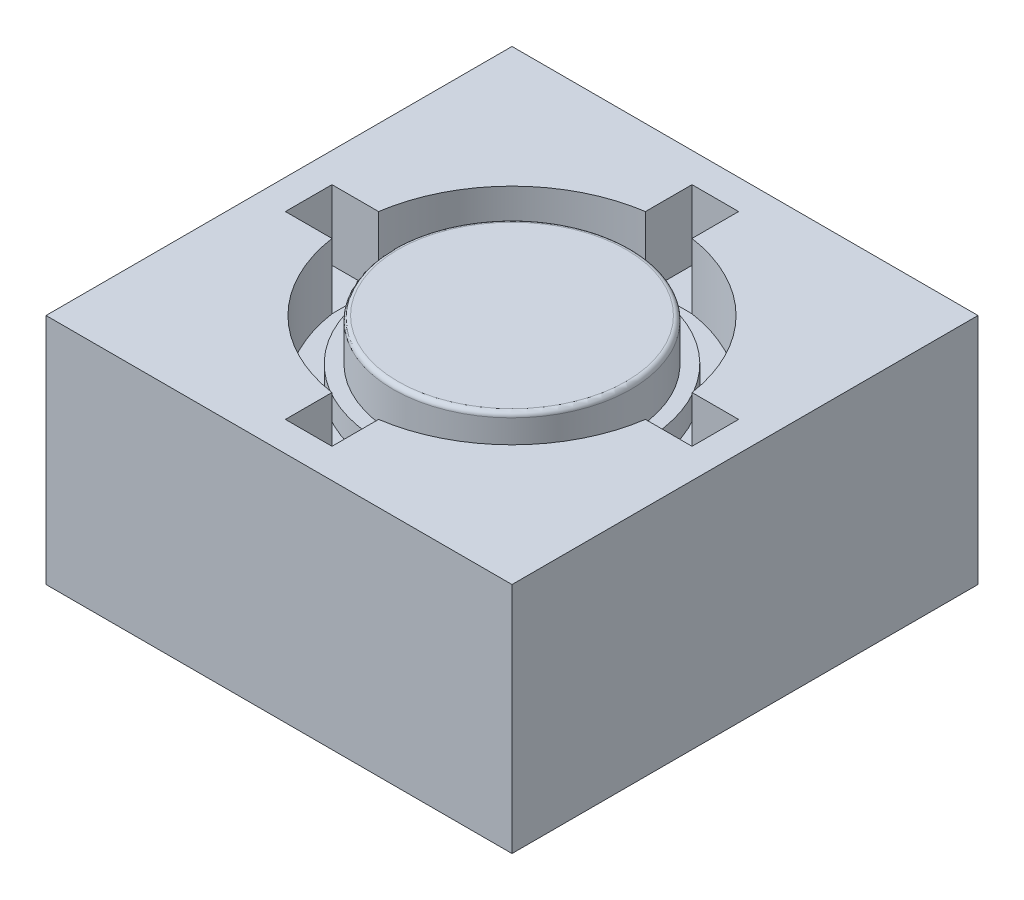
from build123d import *

# Parameters (mm, degrees)
SKETCH1_W           = 20
SKETCH1_H           = 20
BOSS_EXTRUDE1_DEPTH = 10
SKETCH3_R           = 6.8
SKETCH3_R_2         = 5.1
CUT_EXTRUDE1_DEPTH  = 2.8
FILLET1_R           = 0.2
SKETCH5_R           = 5.7
BOSS_EXTRUDE2_DEPTH = 1
SKETCH6_W           = 2
SKETCH6_H           = 2
CUT_EXTRUDE2_DEPTH  = 3
CIRPATTERN1_COUNT   = 2
CIRPATTERN1_ANGLE   = 90


with BuildPart() as part:
    # Sketch1 → Boss-Extrude1 (new body)
    with BuildSketch(Plane(origin=(0, 0, 0), x_dir=(1, 0, 0), z_dir=(0, 1, 0))):
        Rectangle(SKETCH1_W, SKETCH1_H)
    extrude(amount=BOSS_EXTRUDE1_DEPTH)

    # Sketch3 → Cut-Extrude1 (cut)
    with BuildSketch(Plane(origin=(0, 10, 0), x_dir=(1, 0, 0), z_dir=(0, 1, 0))):
        with Locations(Location((0, 0, 0), (0, 0, 270))):
            Circle(SKETCH3_R)
        with Locations(Location((0, 0, 0), (0, 0, 270))):
            Circle(SKETCH3_R_2, mode=Mode.SUBTRACT)
    extrude(amount=-CUT_EXTRUDE1_DEPTH, mode=Mode.SUBTRACT)

    # Fillet1
    fillet1_edges = [part.edges().sort_by_distance(p)[0] for p in [
        (0, 10, -5.1),
    ]]
    fillet(fillet1_edges, radius=FILLET1_R)

    # Sketch5 → Boss-Extrude2 (add)
    with BuildSketch(Plane(origin=(0, 7.2, 0), x_dir=(1, 0, 0), z_dir=(0, 1, 0))):
        with Locations(Location((0, 0, 0), (0, 0, 270))):
            Circle(SKETCH5_R)
    extrude(amount=BOSS_EXTRUDE2_DEPTH)

    # Sketch6 → Cut-Extrude2 (cut)
    with BuildSketch(Plane(origin=(0, 10, 0), x_dir=(1, 0, 0), z_dir=(0, 1, 0))):
        with Locations((0, 7.726068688)):
            Rectangle(SKETCH6_W, SKETCH6_H)
        with Locations((0, -7.726068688)):
            Rectangle(SKETCH6_W, SKETCH6_H)
    cut_extrude2 = extrude(amount=-CUT_EXTRUDE2_DEPTH, mode=Mode.SUBTRACT)

    # CirPattern1: Cut-Extrude2 ×2 about axis
    cirpattern1_axis = Axis((0, 0, 0), (0, -1, 0))
    for i in range(1, CIRPATTERN1_COUNT):
        add(cut_extrude2.rotate(cirpattern1_axis, i * CIRPATTERN1_ANGLE / (CIRPATTERN1_COUNT - 1)), mode=Mode.SUBTRACT)


solid = part.part
